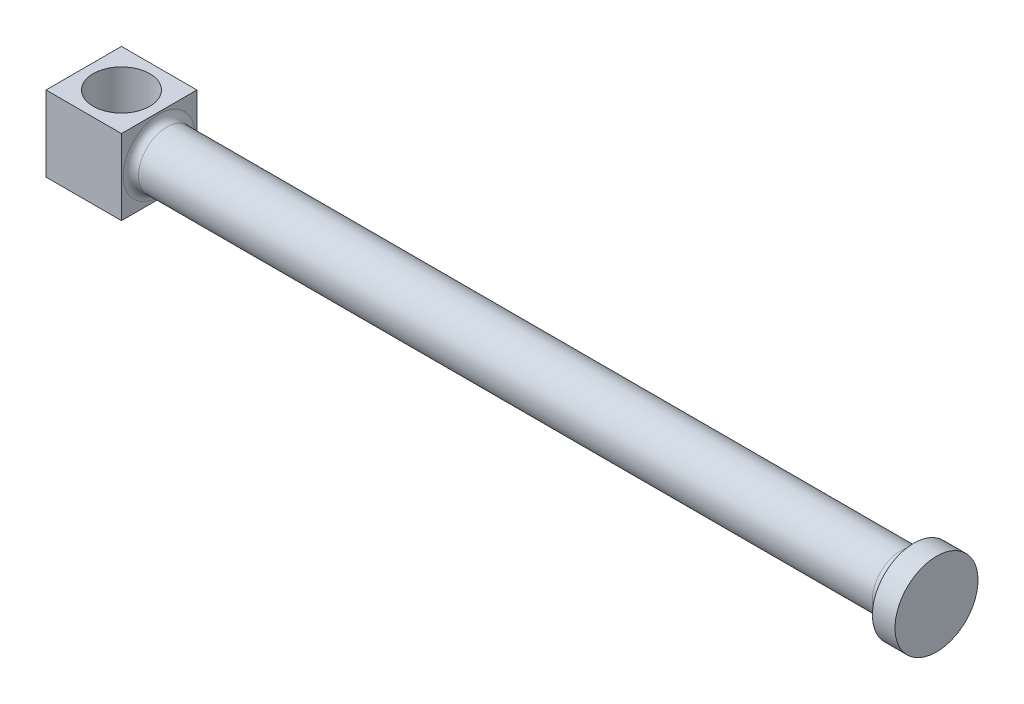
ISO-10303-21;
HEADER;
FILE_DESCRIPTION(('STEP AP214'),'2;1');
FILE_NAME('part.step','',(''),(''),'','','');
FILE_SCHEMA(('AUTOMOTIVE_DESIGN { 1 0 10303 214 1 1 1 1 }'));
ENDSEC;
DATA;
#1=APPLICATION_CONTEXT('core data for automotive mechanical design processes');
#2=APPLICATION_PROTOCOL_DEFINITION('international standard','automotive_design',2000,#1);
#3=PRODUCT_CONTEXT('',#1,'mechanical');
#4=PRODUCT('Part','Part','',(#3));
#5=PRODUCT_RELATED_PRODUCT_CATEGORY('part','',(#4));
#6=PRODUCT_DEFINITION_FORMATION('','',#4);
#7=PRODUCT_DEFINITION_CONTEXT('part definition',#1,'design');
#8=PRODUCT_DEFINITION('design','',#6,#7);
#9=PRODUCT_DEFINITION_SHAPE('','',#8);
#10=(LENGTH_UNIT() NAMED_UNIT(*) SI_UNIT(.MILLI.,.METRE.));
#11=(NAMED_UNIT(*) PLANE_ANGLE_UNIT() SI_UNIT($,.RADIAN.));
#12=(NAMED_UNIT(*) SI_UNIT($,.STERADIAN.) SOLID_ANGLE_UNIT());
#13=UNCERTAINTY_MEASURE_WITH_UNIT(LENGTH_MEASURE(1.E-05),#10,'distance_accuracy_value','');
#14=(GEOMETRIC_REPRESENTATION_CONTEXT(3) GLOBAL_UNCERTAINTY_ASSIGNED_CONTEXT((#13)) GLOBAL_UNIT_ASSIGNED_CONTEXT((#10,
#11,#12)) REPRESENTATION_CONTEXT('',''));
#15=CARTESIAN_POINT('',(0.,0.,0.));
#16=DIRECTION('',(0.,0.,1.));
#17=DIRECTION('',(1.,0.,0.));
#18=AXIS2_PLACEMENT_3D('',#15,#16,#17);
#19=CARTESIAN_POINT('',(200.,-178.090894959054,24.4866468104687));
#20=DIRECTION('',(0.,0.,-1.));
#21=DIRECTION('',(0.,1.,0.));
#22=AXIS2_PLACEMENT_3D('',#19,#20,#21);
#23=PLANE('',#22);
#24=DIRECTION('',(0.,-1.,0.));
#25=VECTOR('',#24,1.);
#26=CARTESIAN_POINT('',(0.,-178.090894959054,24.4866468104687));
#27=LINE('',#26,#25);
#28=CARTESIAN_POINT('',(0.,21.9091050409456,24.4866468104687));
#29=VERTEX_POINT('',#28);
#30=CARTESIAN_POINT('',(0.,-178.090894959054,24.4866468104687));
#31=VERTEX_POINT('',#30);
#32=EDGE_CURVE('E107',#29,#31,#27,.T.);
#33=ORIENTED_EDGE('',*,*,#32,.T.);
#34=DIRECTION('',(-1.,0.,0.));
#35=VECTOR('',#34,1.);
#36=CARTESIAN_POINT('',(200.,-178.090894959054,24.4866468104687));
#37=LINE('',#36,#35);
#38=CARTESIAN_POINT('',(200.,-178.090894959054,24.4866468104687));
#39=VERTEX_POINT('',#38);
#40=EDGE_CURVE('E98',#39,#31,#37,.T.);
#41=ORIENTED_EDGE('',*,*,#40,.F.);
#42=DIRECTION('',(0.,-1.,0.));
#43=VECTOR('',#42,1.);
#44=CARTESIAN_POINT('',(200.,-178.090894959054,24.4866468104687));
#45=LINE('',#44,#43);
#46=CARTESIAN_POINT('',(200.,21.9091050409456,24.4866468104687));
#47=VERTEX_POINT('',#46);
#48=EDGE_CURVE('E92',#47,#39,#45,.T.);
#49=ORIENTED_EDGE('',*,*,#48,.F.);
#50=DIRECTION('',(-1.,0.,0.));
#51=VECTOR('',#50,1.);
#52=CARTESIAN_POINT('',(200.,21.9091050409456,24.4866468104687));
#53=LINE('',#52,#51);
#54=EDGE_CURVE('E103',#47,#29,#53,.T.);
#55=ORIENTED_EDGE('',*,*,#54,.T.);
#56=EDGE_LOOP('',(#33,#41,#49,#55));
#57=FACE_BOUND('',#56,.T.);
#58=ADVANCED_FACE('F39',(#57),#23,.F.);
#59=CARTESIAN_POINT('',(200.,-178.090894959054,-175.513353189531));
#60=DIRECTION('',(0.,1.,0.));
#61=DIRECTION('',(0.,0.,1.));
#62=AXIS2_PLACEMENT_3D('',#59,#60,#61);
#63=PLANE('',#62);
#64=CARTESIAN_POINT('',(100.,-178.090894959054,-75.5133531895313));
#65=DIRECTION('',(0.,1.,0.));
#66=DIRECTION('',(0.,0.,1.));
#67=AXIS2_PLACEMENT_3D('',#64,#65,#66);
#68=CIRCLE('',#67,75.);
#69=CARTESIAN_POINT('',(100.,-178.090894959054,-0.513353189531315));
#70=VERTEX_POINT('',#69);
#71=EDGE_CURVE('E110',#70,#70,#68,.T.);
#72=ORIENTED_EDGE('',*,*,#71,.T.);
#73=EDGE_LOOP('',(#72));
#74=FACE_BOUND('',#73,.T.);
#75=DIRECTION('',(0.,0.,-1.));
#76=VECTOR('',#75,1.);
#77=CARTESIAN_POINT('',(0.,-178.090894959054,-175.513353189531));
#78=LINE('',#77,#76);
#79=CARTESIAN_POINT('',(0.,-178.090894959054,-175.513353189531));
#80=VERTEX_POINT('',#79);
#81=EDGE_CURVE('E97',#31,#80,#78,.T.);
#82=ORIENTED_EDGE('',*,*,#81,.T.);
#83=DIRECTION('',(-1.,0.,0.));
#84=VECTOR('',#83,1.);
#85=CARTESIAN_POINT('',(200.,-178.090894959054,-175.513353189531));
#86=LINE('',#85,#84);
#87=CARTESIAN_POINT('',(200.,-178.090894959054,-175.513353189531));
#88=VERTEX_POINT('',#87);
#89=EDGE_CURVE('E95',#88,#80,#86,.T.);
#90=ORIENTED_EDGE('',*,*,#89,.F.);
#91=DIRECTION('',(0.,0.,-1.));
#92=VECTOR('',#91,1.);
#93=CARTESIAN_POINT('',(200.,-178.090894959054,-175.513353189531));
#94=LINE('',#93,#92);
#95=EDGE_CURVE('E87',#39,#88,#94,.T.);
#96=ORIENTED_EDGE('',*,*,#95,.F.);
#97=ORIENTED_EDGE('',*,*,#40,.T.);
#98=EDGE_LOOP('',(#82,#90,#96,#97));
#99=FACE_BOUND('',#98,.T.);
#100=ADVANCED_FACE('F96',(#74,#99),#63,.F.);
#101=CARTESIAN_POINT('',(200.,21.9091050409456,-175.513353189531));
#102=DIRECTION('',(0.,0.,1.));
#103=DIRECTION('',(0.,-1.,0.));
#104=AXIS2_PLACEMENT_3D('',#101,#102,#103);
#105=PLANE('',#104);
#106=DIRECTION('',(0.,1.,0.));
#107=VECTOR('',#106,1.);
#108=CARTESIAN_POINT('',(0.,21.9091050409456,-175.513353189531));
#109=LINE('',#108,#107);
#110=CARTESIAN_POINT('',(0.,21.9091050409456,-175.513353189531));
#111=VERTEX_POINT('',#110);
#112=EDGE_CURVE('E73',#80,#111,#109,.T.);
#113=ORIENTED_EDGE('',*,*,#112,.T.);
#114=DIRECTION('',(-1.,0.,0.));
#115=VECTOR('',#114,1.);
#116=CARTESIAN_POINT('',(200.,21.9091050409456,-175.513353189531));
#117=LINE('',#116,#115);
#118=CARTESIAN_POINT('',(200.,21.9091050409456,-175.513353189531));
#119=VERTEX_POINT('',#118);
#120=EDGE_CURVE('E99',#119,#111,#117,.T.);
#121=ORIENTED_EDGE('',*,*,#120,.F.);
#122=DIRECTION('',(0.,1.,0.));
#123=VECTOR('',#122,1.);
#124=CARTESIAN_POINT('',(200.,21.9091050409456,-175.513353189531));
#125=LINE('',#124,#123);
#126=EDGE_CURVE('E90',#88,#119,#125,.T.);
#127=ORIENTED_EDGE('',*,*,#126,.F.);
#128=ORIENTED_EDGE('',*,*,#89,.T.);
#129=EDGE_LOOP('',(#113,#121,#127,#128));
#130=FACE_BOUND('',#129,.T.);
#131=ADVANCED_FACE('F101',(#130),#105,.F.);
#132=CARTESIAN_POINT('',(200.,21.9091050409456,24.4866468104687));
#133=DIRECTION('',(0.,-1.,0.));
#134=DIRECTION('',(0.,0.,-1.));
#135=AXIS2_PLACEMENT_3D('',#132,#133,#134);
#136=PLANE('',#135);
#137=CARTESIAN_POINT('',(100.,21.9091050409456,-75.5133531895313));
#138=DIRECTION('',(0.,1.,0.));
#139=DIRECTION('',(0.,0.,1.));
#140=AXIS2_PLACEMENT_3D('',#137,#138,#139);
#141=CIRCLE('',#140,75.);
#142=CARTESIAN_POINT('',(100.,21.9091050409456,-0.513353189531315));
#143=VERTEX_POINT('',#142);
#144=EDGE_CURVE('E200',#143,#143,#141,.T.);
#145=ORIENTED_EDGE('',*,*,#144,.F.);
#146=EDGE_LOOP('',(#145));
#147=FACE_BOUND('',#146,.T.);
#148=DIRECTION('',(0.,0.,1.));
#149=VECTOR('',#148,1.);
#150=CARTESIAN_POINT('',(0.,21.9091050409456,24.4866468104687));
#151=LINE('',#150,#149);
#152=EDGE_CURVE('E79',#111,#29,#151,.T.);
#153=ORIENTED_EDGE('',*,*,#152,.T.);
#154=ORIENTED_EDGE('',*,*,#54,.F.);
#155=DIRECTION('',(0.,0.,1.));
#156=VECTOR('',#155,1.);
#157=CARTESIAN_POINT('',(200.,21.9091050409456,24.4866468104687));
#158=LINE('',#157,#156);
#159=EDGE_CURVE('E56',#119,#47,#158,.T.);
#160=ORIENTED_EDGE('',*,*,#159,.F.);
#161=ORIENTED_EDGE('',*,*,#120,.T.);
#162=EDGE_LOOP('',(#153,#154,#160,#161));
#163=FACE_BOUND('',#162,.T.);
#164=ADVANCED_FACE('F156',(#147,#163),#136,.F.);
#165=CARTESIAN_POINT('',(200.,0.,0.));
#166=DIRECTION('',(-1.,0.,0.));
#167=DIRECTION('',(0.,0.,1.));
#168=AXIS2_PLACEMENT_3D('',#165,#166,#167);
#169=PLANE('',#168);
#170=CARTESIAN_POINT('',(200.,-78.0908949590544,-75.5133531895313));
#171=DIRECTION('',(-1.,0.,0.));
#172=DIRECTION('',(0.,0.,1.));
#173=AXIS2_PLACEMENT_3D('',#170,#171,#172);
#174=CIRCLE('',#173,95.);
#175=CARTESIAN_POINT('',(200.,-78.0908949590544,19.4866468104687));
#176=VERTEX_POINT('',#175);
#177=EDGE_CURVE('E48',#176,#176,#174,.T.);
#178=ORIENTED_EDGE('',*,*,#177,.T.);
#179=EDGE_LOOP('',(#178));
#180=FACE_BOUND('',#179,.T.);
#181=ORIENTED_EDGE('',*,*,#48,.T.);
#182=ORIENTED_EDGE('',*,*,#95,.T.);
#183=ORIENTED_EDGE('',*,*,#126,.T.);
#184=ORIENTED_EDGE('',*,*,#159,.T.);
#185=EDGE_LOOP('',(#181,#182,#183,#184));
#186=FACE_BOUND('',#185,.T.);
#187=ADVANCED_FACE('F88',(#180,#186),#169,.F.);
#188=CARTESIAN_POINT('',(0.,0.,0.));
#189=DIRECTION('',(-1.,0.,0.));
#190=DIRECTION('',(0.,0.,1.));
#191=AXIS2_PLACEMENT_3D('',#188,#189,#190);
#192=PLANE('',#191);
#193=ORIENTED_EDGE('',*,*,#32,.F.);
#194=ORIENTED_EDGE('',*,*,#152,.F.);
#195=ORIENTED_EDGE('',*,*,#112,.F.);
#196=ORIENTED_EDGE('',*,*,#81,.F.);
#197=EDGE_LOOP('',(#193,#194,#195,#196));
#198=FACE_BOUND('',#197,.T.);
#199=ADVANCED_FACE('F142',(#198),#192,.T.);
#200=CARTESIAN_POINT('',(100.,-178.090894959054,-75.5133531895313));
#201=DIRECTION('',(0.,1.,0.));
#202=DIRECTION('',(0.,0.,1.));
#203=AXIS2_PLACEMENT_3D('',#200,#201,#202);
#204=CYLINDRICAL_SURFACE('',#203,75.);
#205=ORIENTED_EDGE('',*,*,#71,.F.);
#206=EDGE_LOOP('',(#205));
#207=FACE_BOUND('',#206,.T.);
#208=ORIENTED_EDGE('',*,*,#144,.T.);
#209=EDGE_LOOP('',(#208));
#210=FACE_BOUND('',#209,.T.);
#211=ADVANCED_FACE('F132',(#207,#210),#204,.F.);
#212=CARTESIAN_POINT('',(2200.,-78.0908949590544,-75.5133531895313));
#213=DIRECTION('',(-1.,0.,0.));
#214=DIRECTION('',(0.,0.,1.));
#215=AXIS2_PLACEMENT_3D('',#212,#213,#214);
#216=CYLINDRICAL_SURFACE('',#215,75.);
#217=CARTESIAN_POINT('',(2165.,-78.0908949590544,-75.5133531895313));
#218=DIRECTION('',(1.,0.,0.));
#219=DIRECTION('',(0.,0.,-1.));
#220=AXIS2_PLACEMENT_3D('',#217,#218,#219);
#221=CIRCLE('',#220,75.);
#222=CARTESIAN_POINT('',(2165.,-78.0908949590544,-150.513353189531));
#223=VERTEX_POINT('',#222);
#224=EDGE_CURVE('E11',#223,#223,#221,.F.);
#225=ORIENTED_EDGE('',*,*,#224,.T.);
#226=EDGE_LOOP('',(#225));
#227=FACE_BOUND('',#226,.T.);
#228=CARTESIAN_POINT('',(220.,-78.0908949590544,-75.5133531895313));
#229=DIRECTION('',(-1.,0.,0.));
#230=DIRECTION('',(0.,0.,1.));
#231=AXIS2_PLACEMENT_3D('',#228,#229,#230);
#232=CIRCLE('',#231,75.);
#233=CARTESIAN_POINT('',(220.,-78.0908949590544,-0.513353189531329));
#234=VERTEX_POINT('',#233);
#235=EDGE_CURVE('E117',#234,#234,#232,.F.);
#236=ORIENTED_EDGE('',*,*,#235,.T.);
#237=EDGE_LOOP('',(#236));
#238=FACE_BOUND('',#237,.T.);
#239=ADVANCED_FACE('F129',(#227,#238),#216,.T.);
#240=CARTESIAN_POINT('',(2260.,-78.0908949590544,-75.5133531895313));
#241=DIRECTION('',(-1.,0.,0.));
#242=DIRECTION('',(0.,0.,1.));
#243=AXIS2_PLACEMENT_3D('',#240,#241,#242);
#244=CYLINDRICAL_SURFACE('',#243,110.);
#245=CARTESIAN_POINT('',(2260.,-78.0908949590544,-75.5133531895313));
#246=DIRECTION('',(1.,0.,0.));
#247=DIRECTION('',(0.,0.,-1.));
#248=AXIS2_PLACEMENT_3D('',#245,#246,#247);
#249=CIRCLE('',#248,110.);
#250=CARTESIAN_POINT('',(2260.,-78.0908949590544,-185.513353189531));
#251=VERTEX_POINT('',#250);
#252=EDGE_CURVE('E197',#251,#251,#249,.T.);
#253=ORIENTED_EDGE('',*,*,#252,.F.);
#254=EDGE_LOOP('',(#253));
#255=FACE_BOUND('',#254,.T.);
#256=CARTESIAN_POINT('',(2200.,-78.0908949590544,-75.5133531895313));
#257=DIRECTION('',(1.,0.,0.));
#258=DIRECTION('',(0.,0.,-1.));
#259=AXIS2_PLACEMENT_3D('',#256,#257,#258);
#260=CIRCLE('',#259,110.);
#261=CARTESIAN_POINT('',(2200.,-78.0908949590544,-185.513353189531));
#262=VERTEX_POINT('',#261);
#263=EDGE_CURVE('E195',#262,#262,#260,.T.);
#264=ORIENTED_EDGE('',*,*,#263,.T.);
#265=EDGE_LOOP('',(#264));
#266=FACE_BOUND('',#265,.T.);
#267=ADVANCED_FACE('F131',(#255,#266),#244,.T.);
#268=CARTESIAN_POINT('',(2260.,-78.0908949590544,-75.5133531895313));
#269=DIRECTION('',(1.,0.,0.));
#270=DIRECTION('',(0.,0.,-1.));
#271=AXIS2_PLACEMENT_3D('',#268,#269,#270);
#272=PLANE('',#271);
#273=ORIENTED_EDGE('',*,*,#252,.T.);
#274=EDGE_LOOP('',(#273));
#275=FACE_BOUND('',#274,.T.);
#276=ADVANCED_FACE('F126',(#275),#272,.T.);
#277=CARTESIAN_POINT('',(220.,-78.0908949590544,-75.5133531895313));
#278=DIRECTION('',(-1.,0.,0.));
#279=DIRECTION('',(0.,0.,1.));
#280=AXIS2_PLACEMENT_3D('',#277,#278,#279);
#281=TOROIDAL_SURFACE('',#280,95.,20.);
#282=ORIENTED_EDGE('',*,*,#177,.F.);
#283=EDGE_LOOP('',(#282));
#284=FACE_BOUND('',#283,.T.);
#285=ORIENTED_EDGE('',*,*,#235,.F.);
#286=EDGE_LOOP('',(#285));
#287=FACE_BOUND('',#286,.T.);
#288=ADVANCED_FACE('F123',(#284,#287),#281,.F.);
#289=CARTESIAN_POINT('',(2165.,-78.0908949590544,-75.5133531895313));
#290=DIRECTION('',(1.,0.,0.));
#291=DIRECTION('',(0.,0.,-1.));
#292=AXIS2_PLACEMENT_3D('',#289,#290,#291);
#293=TOROIDAL_SURFACE('',#292,110.,35.);
#294=ORIENTED_EDGE('',*,*,#224,.F.);
#295=EDGE_LOOP('',(#294));
#296=FACE_BOUND('',#295,.T.);
#297=ORIENTED_EDGE('',*,*,#263,.F.);
#298=EDGE_LOOP('',(#297));
#299=FACE_BOUND('',#298,.T.);
#300=ADVANCED_FACE('F41',(#296,#299),#293,.F.);
#301=CLOSED_SHELL('',(#58,#100,#131,#164,#187,#199,#211,#239,#267,#276,#288,#300));
#302=MANIFOLD_SOLID_BREP('B2',#301);
#303=ADVANCED_BREP_SHAPE_REPRESENTATION('',(#18,#302),#14);
#304=SHAPE_DEFINITION_REPRESENTATION(#9,#303);
ENDSEC;
END-ISO-10303-21;
